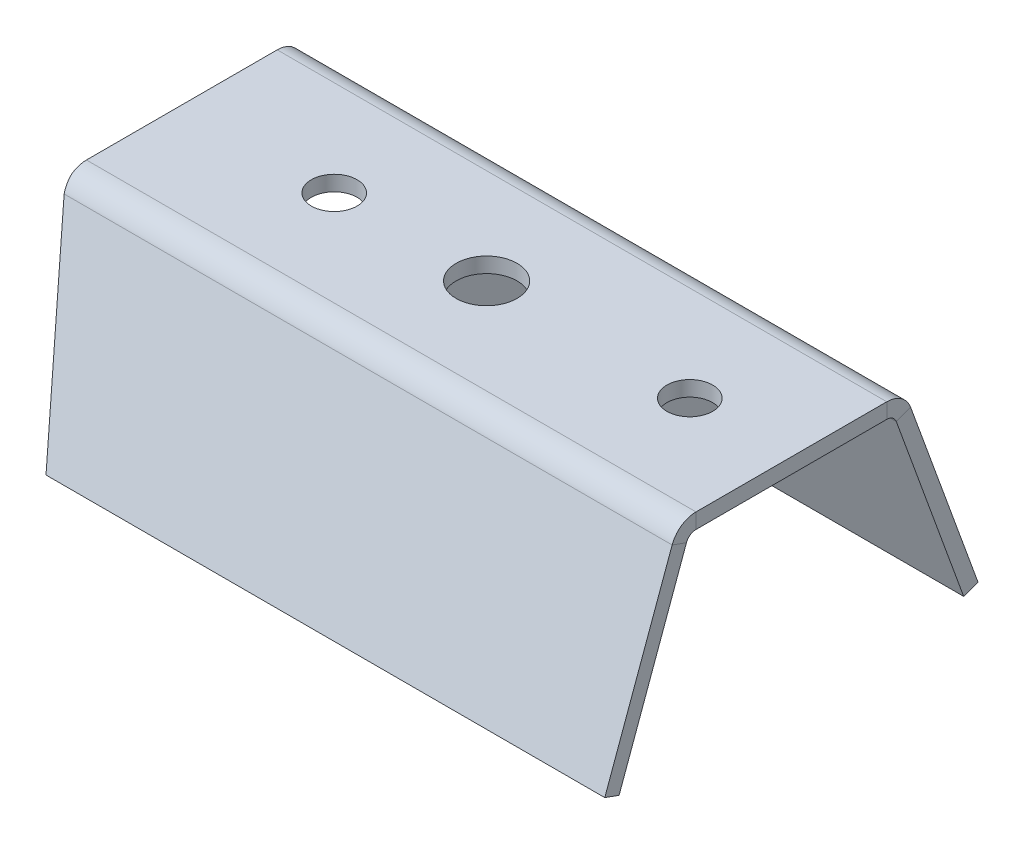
ISO-10303-21;
HEADER;
FILE_DESCRIPTION(('STEP AP214'),'2;1');
FILE_NAME('part.step','',(''),(''),'','','');
FILE_SCHEMA(('AUTOMOTIVE_DESIGN { 1 0 10303 214 1 1 1 1 }'));
ENDSEC;
DATA;
#1=APPLICATION_CONTEXT('core data for automotive mechanical design processes');
#2=APPLICATION_PROTOCOL_DEFINITION('international standard','automotive_design',2000,#1);
#3=PRODUCT_CONTEXT('',#1,'mechanical');
#4=PRODUCT('Part','Part','',(#3));
#5=PRODUCT_RELATED_PRODUCT_CATEGORY('part','',(#4));
#6=PRODUCT_DEFINITION_FORMATION('','',#4);
#7=PRODUCT_DEFINITION_CONTEXT('part definition',#1,'design');
#8=PRODUCT_DEFINITION('design','',#6,#7);
#9=PRODUCT_DEFINITION_SHAPE('','',#8);
#10=(LENGTH_UNIT() NAMED_UNIT(*) SI_UNIT(.MILLI.,.METRE.));
#11=(NAMED_UNIT(*) PLANE_ANGLE_UNIT() SI_UNIT($,.RADIAN.));
#12=(NAMED_UNIT(*) SI_UNIT($,.STERADIAN.) SOLID_ANGLE_UNIT());
#13=UNCERTAINTY_MEASURE_WITH_UNIT(LENGTH_MEASURE(1.E-05),#10,'distance_accuracy_value','');
#14=(GEOMETRIC_REPRESENTATION_CONTEXT(3) GLOBAL_UNCERTAINTY_ASSIGNED_CONTEXT((#13)) GLOBAL_UNIT_ASSIGNED_CONTEXT((#10,
#11,#12)) REPRESENTATION_CONTEXT('',''));
#15=CARTESIAN_POINT('',(0.,0.,0.));
#16=DIRECTION('',(0.,0.,1.));
#17=DIRECTION('',(1.,0.,0.));
#18=AXIS2_PLACEMENT_3D('',#15,#16,#17);
#19=CARTESIAN_POINT('',(60.,1.5,30.));
#20=DIRECTION('',(-1.,0.,0.));
#21=DIRECTION('',(0.,0.,1.));
#22=AXIS2_PLACEMENT_3D('',#19,#20,#21);
#23=PLANE('',#22);
#24=DIRECTION('',(0.,0.,-1.));
#25=VECTOR('',#24,1.);
#26=CARTESIAN_POINT('',(60.,1.5,30.));
#27=LINE('',#26,#25);
#28=CARTESIAN_POINT('',(60.,1.5,9.38912559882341));
#29=VERTEX_POINT('',#28);
#30=CARTESIAN_POINT('',(60.,1.5,-9.38912559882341));
#31=VERTEX_POINT('',#30);
#32=EDGE_CURVE('E476',#29,#31,#27,.T.);
#33=ORIENTED_EDGE('',*,*,#32,.F.);
#34=DIRECTION('',(0.,-1.,0.));
#35=VECTOR('',#34,1.);
#36=CARTESIAN_POINT('',(60.,1.5,9.38912559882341));
#37=LINE('',#36,#35);
#38=CARTESIAN_POINT('',(60.,0.,9.38912559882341));
#39=VERTEX_POINT('',#38);
#40=EDGE_CURVE('E12',#29,#39,#37,.T.);
#41=ORIENTED_EDGE('',*,*,#40,.T.);
#42=DIRECTION('',(0.,0.,-1.));
#43=VECTOR('',#42,1.);
#44=CARTESIAN_POINT('',(60.,0.,30.));
#45=LINE('',#44,#43);
#46=CARTESIAN_POINT('',(60.,0.,-9.38912559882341));
#47=VERTEX_POINT('',#46);
#48=EDGE_CURVE('E487',#39,#47,#45,.T.);
#49=ORIENTED_EDGE('',*,*,#48,.T.);
#50=DIRECTION('',(0.,-1.,0.));
#51=VECTOR('',#50,1.);
#52=CARTESIAN_POINT('',(60.,1.5,-9.38912559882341));
#53=LINE('',#52,#51);
#54=EDGE_CURVE('E478',#31,#47,#53,.T.);
#55=ORIENTED_EDGE('',*,*,#54,.F.);
#56=EDGE_LOOP('',(#33,#41,#49,#55));
#57=FACE_BOUND('',#56,.T.);
#58=ADVANCED_FACE('F55',(#57),#23,.F.);
#59=CARTESIAN_POINT('',(0.,1.5,-10.));
#60=DIRECTION('',(1.,0.,0.));
#61=DIRECTION('',(0.,0.,-1.));
#62=AXIS2_PLACEMENT_3D('',#59,#60,#61);
#63=PLANE('',#62);
#64=DIRECTION('',(0.,0.,1.));
#65=VECTOR('',#64,1.);
#66=CARTESIAN_POINT('',(0.,0.,-10.));
#67=LINE('',#66,#65);
#68=CARTESIAN_POINT('',(0.,0.,-9.38912559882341));
#69=VERTEX_POINT('',#68);
#70=CARTESIAN_POINT('',(0.,0.,9.38912559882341));
#71=VERTEX_POINT('',#70);
#72=EDGE_CURVE('E79',#69,#71,#67,.T.);
#73=ORIENTED_EDGE('',*,*,#72,.T.);
#74=DIRECTION('',(0.,1.,0.));
#75=VECTOR('',#74,1.);
#76=CARTESIAN_POINT('',(0.,1.5,9.38912559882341));
#77=LINE('',#76,#75);
#78=CARTESIAN_POINT('',(0.,1.5,9.38912559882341));
#79=VERTEX_POINT('',#78);
#80=EDGE_CURVE('E564',#71,#79,#77,.T.);
#81=ORIENTED_EDGE('',*,*,#80,.T.);
#82=DIRECTION('',(0.,0.,1.));
#83=VECTOR('',#82,1.);
#84=CARTESIAN_POINT('',(0.,1.5,-10.));
#85=LINE('',#84,#83);
#86=CARTESIAN_POINT('',(0.,1.5,-9.38912559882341));
#87=VERTEX_POINT('',#86);
#88=EDGE_CURVE('E483',#87,#79,#85,.T.);
#89=ORIENTED_EDGE('',*,*,#88,.F.);
#90=DIRECTION('',(0.,1.,0.));
#91=VECTOR('',#90,1.);
#92=CARTESIAN_POINT('',(0.,1.5,-9.38912559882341));
#93=LINE('',#92,#91);
#94=EDGE_CURVE('E565',#69,#87,#93,.T.);
#95=ORIENTED_EDGE('',*,*,#94,.F.);
#96=EDGE_LOOP('',(#73,#81,#89,#95));
#97=FACE_BOUND('',#96,.T.);
#98=ADVANCED_FACE('F457',(#97),#63,.F.);
#99=CARTESIAN_POINT('',(0.,0.,-30.));
#100=DIRECTION('',(0.,1.,0.));
#101=DIRECTION('',(0.,0.,1.));
#102=AXIS2_PLACEMENT_3D('',#99,#100,#101);
#103=PLANE('',#102);
#104=CARTESIAN_POINT('',(15.,0.,0.));
#105=DIRECTION('',(0.,1.,0.));
#106=DIRECTION('',(0.,0.,1.));
#107=AXIS2_PLACEMENT_3D('',#104,#105,#106);
#108=CIRCLE('',#107,2.25);
#109=CARTESIAN_POINT('',(15.,0.,2.25));
#110=VERTEX_POINT('',#109);
#111=EDGE_CURVE('E606',#110,#110,#108,.T.);
#112=ORIENTED_EDGE('',*,*,#111,.T.);
#113=EDGE_LOOP('',(#112));
#114=FACE_BOUND('',#113,.T.);
#115=CARTESIAN_POINT('',(50.,0.,0.));
#116=DIRECTION('',(0.,1.,0.));
#117=DIRECTION('',(0.,0.,1.));
#118=AXIS2_PLACEMENT_3D('',#115,#116,#117);
#119=CIRCLE('',#118,2.24999999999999);
#120=CARTESIAN_POINT('',(50.,0.,2.24999999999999));
#121=VERTEX_POINT('',#120);
#122=EDGE_CURVE('E571',#121,#121,#119,.T.);
#123=ORIENTED_EDGE('',*,*,#122,.T.);
#124=EDGE_LOOP('',(#123));
#125=FACE_BOUND('',#124,.T.);
#126=CARTESIAN_POINT('',(30.,0.,0.));
#127=DIRECTION('',(0.,1.,0.));
#128=DIRECTION('',(0.,0.,1.));
#129=AXIS2_PLACEMENT_3D('',#126,#127,#128);
#130=CIRCLE('',#129,3.);
#131=CARTESIAN_POINT('',(30.,0.,3.));
#132=VERTEX_POINT('',#131);
#133=EDGE_CURVE('E578',#132,#132,#130,.T.);
#134=ORIENTED_EDGE('',*,*,#133,.T.);
#135=EDGE_LOOP('',(#134));
#136=FACE_BOUND('',#135,.T.);
#137=ORIENTED_EDGE('',*,*,#48,.F.);
#138=DIRECTION('',(-1.,0.,0.));
#139=VECTOR('',#138,1.);
#140=CARTESIAN_POINT('',(0.,0.,9.38912559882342));
#141=LINE('',#140,#139);
#142=EDGE_CURVE('E63',#39,#71,#141,.T.);
#143=ORIENTED_EDGE('',*,*,#142,.T.);
#144=ORIENTED_EDGE('',*,*,#72,.F.);
#145=DIRECTION('',(-1.,0.,0.));
#146=VECTOR('',#145,1.);
#147=CARTESIAN_POINT('',(0.,0.,-9.38912559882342));
#148=LINE('',#147,#146);
#149=EDGE_CURVE('E582',#47,#69,#148,.T.);
#150=ORIENTED_EDGE('',*,*,#149,.F.);
#151=EDGE_LOOP('',(#137,#143,#144,#150));
#152=FACE_BOUND('',#151,.T.);
#153=ADVANCED_FACE('F460',(#114,#125,#136,#152),#103,.F.);
#154=CARTESIAN_POINT('',(0.,1.5,-30.));
#155=DIRECTION('',(0.,1.,0.));
#156=DIRECTION('',(0.,0.,1.));
#157=AXIS2_PLACEMENT_3D('',#154,#155,#156);
#158=PLANE('',#157);
#159=DIRECTION('',(-1.,0.,0.));
#160=VECTOR('',#159,1.);
#161=CARTESIAN_POINT('',(0.,1.5,9.38912559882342));
#162=LINE('',#161,#160);
#163=EDGE_CURVE('E557',#29,#79,#162,.T.);
#164=ORIENTED_EDGE('',*,*,#163,.F.);
#165=ORIENTED_EDGE('',*,*,#32,.T.);
#166=DIRECTION('',(-1.,0.,0.));
#167=VECTOR('',#166,1.);
#168=CARTESIAN_POINT('',(0.,1.5,-9.38912559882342));
#169=LINE('',#168,#167);
#170=EDGE_CURVE('E482',#31,#87,#169,.T.);
#171=ORIENTED_EDGE('',*,*,#170,.T.);
#172=ORIENTED_EDGE('',*,*,#88,.T.);
#173=EDGE_LOOP('',(#164,#165,#171,#172));
#174=FACE_BOUND('',#173,.T.);
#175=CARTESIAN_POINT('',(30.,1.5,0.));
#176=DIRECTION('',(0.,1.,0.));
#177=DIRECTION('',(0.,0.,1.));
#178=AXIS2_PLACEMENT_3D('',#175,#176,#177);
#179=CIRCLE('',#178,3.);
#180=CARTESIAN_POINT('',(30.,1.5,3.));
#181=VERTEX_POINT('',#180);
#182=EDGE_CURVE('E575',#181,#181,#179,.T.);
#183=ORIENTED_EDGE('',*,*,#182,.F.);
#184=EDGE_LOOP('',(#183));
#185=FACE_BOUND('',#184,.T.);
#186=CARTESIAN_POINT('',(50.,1.5,0.));
#187=DIRECTION('',(0.,1.,0.));
#188=DIRECTION('',(0.,0.,1.));
#189=AXIS2_PLACEMENT_3D('',#186,#187,#188);
#190=CIRCLE('',#189,2.24999999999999);
#191=CARTESIAN_POINT('',(50.,1.5,2.24999999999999));
#192=VERTEX_POINT('',#191);
#193=EDGE_CURVE('E569',#192,#192,#190,.T.);
#194=ORIENTED_EDGE('',*,*,#193,.F.);
#195=EDGE_LOOP('',(#194));
#196=FACE_BOUND('',#195,.T.);
#197=CARTESIAN_POINT('',(15.,1.5,0.));
#198=DIRECTION('',(0.,1.,0.));
#199=DIRECTION('',(0.,0.,1.));
#200=AXIS2_PLACEMENT_3D('',#197,#198,#199);
#201=CIRCLE('',#200,2.25);
#202=CARTESIAN_POINT('',(15.,1.5,2.25));
#203=VERTEX_POINT('',#202);
#204=EDGE_CURVE('E433',#203,#203,#201,.T.);
#205=ORIENTED_EDGE('',*,*,#204,.F.);
#206=EDGE_LOOP('',(#205));
#207=FACE_BOUND('',#206,.T.);
#208=ADVANCED_FACE('F455',(#174,#185,#196,#207),#158,.T.);
#209=CARTESIAN_POINT('',(50.,1.5,0.));
#210=DIRECTION('',(0.,-1.,0.));
#211=DIRECTION('',(0.,0.,-1.));
#212=AXIS2_PLACEMENT_3D('',#209,#210,#211);
#213=CYLINDRICAL_SURFACE('',#212,2.24999999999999);
#214=ORIENTED_EDGE('',*,*,#193,.T.);
#215=EDGE_LOOP('',(#214));
#216=FACE_BOUND('',#215,.T.);
#217=ORIENTED_EDGE('',*,*,#122,.F.);
#218=EDGE_LOOP('',(#217));
#219=FACE_BOUND('',#218,.T.);
#220=ADVANCED_FACE('F451',(#216,#219),#213,.F.);
#221=CARTESIAN_POINT('',(30.,1.5,0.));
#222=DIRECTION('',(0.,-1.,0.));
#223=DIRECTION('',(0.,0.,-1.));
#224=AXIS2_PLACEMENT_3D('',#221,#222,#223);
#225=CYLINDRICAL_SURFACE('',#224,3.);
#226=ORIENTED_EDGE('',*,*,#182,.T.);
#227=EDGE_LOOP('',(#226));
#228=FACE_BOUND('',#227,.T.);
#229=ORIENTED_EDGE('',*,*,#133,.F.);
#230=EDGE_LOOP('',(#229));
#231=FACE_BOUND('',#230,.T.);
#232=ADVANCED_FACE('F447',(#228,#231),#225,.F.);
#233=CARTESIAN_POINT('',(15.,1.5,0.));
#234=DIRECTION('',(0.,-1.,0.));
#235=DIRECTION('',(0.,0.,-1.));
#236=AXIS2_PLACEMENT_3D('',#233,#234,#235);
#237=CYLINDRICAL_SURFACE('',#236,2.25);
#238=ORIENTED_EDGE('',*,*,#204,.T.);
#239=EDGE_LOOP('',(#238));
#240=FACE_BOUND('',#239,.T.);
#241=ORIENTED_EDGE('',*,*,#111,.F.);
#242=EDGE_LOOP('',(#241));
#243=FACE_BOUND('',#242,.T.);
#244=ADVANCED_FACE('F444',(#240,#243),#237,.F.);
#245=CARTESIAN_POINT('',(60.,-1.,-9.38912559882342));
#246=DIRECTION('',(1.,0.,0.));
#247=DIRECTION('',(0.,0.,-1.));
#248=AXIS2_PLACEMENT_3D('',#245,#246,#247);
#249=PLANE('',#248);
#250=ORIENTED_EDGE('',*,*,#54,.T.);
#251=CARTESIAN_POINT('',(60.,-1.,-9.38912559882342));
#252=DIRECTION('',(-1.,0.,0.));
#253=DIRECTION('',(0.,0.,1.));
#254=AXIS2_PLACEMENT_3D('',#251,#252,#253);
#255=CIRCLE('',#254,1.);
#256=CARTESIAN_POINT('',(60.,-0.657979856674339,-10.3288182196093));
#257=VERTEX_POINT('',#256);
#258=EDGE_CURVE('E310',#47,#257,#255,.T.);
#259=ORIENTED_EDGE('',*,*,#258,.T.);
#260=DIRECTION('',(0.,-0.342020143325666,0.93969262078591));
#261=VECTOR('',#260,1.);
#262=CARTESIAN_POINT('',(60.,-0.14494964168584,-11.7383571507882));
#263=LINE('',#262,#261);
#264=CARTESIAN_POINT('',(60.,-0.14494964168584,-11.7383571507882));
#265=VERTEX_POINT('',#264);
#266=EDGE_CURVE('E315',#265,#257,#263,.T.);
#267=ORIENTED_EDGE('',*,*,#266,.F.);
#268=CARTESIAN_POINT('',(60.,-1.,-9.38912559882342));
#269=DIRECTION('',(-1.,0.,0.));
#270=DIRECTION('',(0.,0.,1.));
#271=AXIS2_PLACEMENT_3D('',#268,#269,#270);
#272=CIRCLE('',#271,2.5);
#273=EDGE_CURVE('E331',#31,#265,#272,.T.);
#274=ORIENTED_EDGE('',*,*,#273,.F.);
#275=EDGE_LOOP('',(#250,#259,#267,#274));
#276=FACE_BOUND('',#275,.T.);
#277=ADVANCED_FACE('F443',(#276),#249,.T.);
#278=CARTESIAN_POINT('',(0.152718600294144,-0.144949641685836,-11.7383571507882));
#279=CARTESIAN_POINT('',(0.101675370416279,0.334692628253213,-11.5637816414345));
#280=CARTESIAN_POINT('',(0.0510432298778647,0.755112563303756,-11.2411820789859));
#281=CARTESIAN_POINT('',(0.,1.04788011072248,-10.823066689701));
#282=CARTESIAN_POINT('',(0.152718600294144,-0.657979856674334,-10.3288182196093));
#283=CARTESIAN_POINT('',(0.101679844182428,-0.46613976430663,-10.2589941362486));
#284=CARTESIAN_POINT('',(0.0510387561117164,-0.29794471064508,-10.1299335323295));
#285=CARTESIAN_POINT('',(0.,-0.180847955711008,-9.96270203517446));
#286=B_SPLINE_SURFACE_WITH_KNOTS('',1,3,((#278,#279,#280,#281),(#282,#283,#284,#285)),
.UNSPECIFIED.,.F.,.F.,.F.,(2,2),(4,4),(0.,1.),(0.,1.),.UNSPECIFIED.);
#287=CARTESIAN_POINT('',(0.152718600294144,-0.144949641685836,-11.7383571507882));
#288=CARTESIAN_POINT('',(0.152718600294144,-0.657979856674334,-10.3288182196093));
#289=B_SPLINE_CURVE_WITH_KNOTS('',1,(#287,#288),.UNSPECIFIED.,.F.,.F.,(2,2),(0.,1.),.UNSPECIFIED.);
#290=CARTESIAN_POINT('',(0.152718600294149,-0.657979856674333,-10.3288182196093));
#291=VERTEX_POINT('',#290);
#292=CARTESIAN_POINT('',(0.152718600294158,-0.144949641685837,-11.7383571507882));
#293=VERTEX_POINT('',#292);
#294=EDGE_CURVE('E311',#291,#293,#289,.F.);
#295=CARTESIAN_POINT('',(0.152718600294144,-0.657979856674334,-10.3288182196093));
#296=CARTESIAN_POINT('',(0.101679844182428,-0.46613976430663,-10.2589941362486));
#297=CARTESIAN_POINT('',(0.0510387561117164,-0.29794471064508,-10.1299335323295));
#298=CARTESIAN_POINT('',(0.,-0.180847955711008,-9.96270203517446));
#299=B_SPLINE_CURVE_WITH_KNOTS('',3,(#295,#296,#297,#298),.UNSPECIFIED.,.F.,.F.,(4,4),(0.,1.),.UNSPECIFIED.);
#300=CARTESIAN_POINT('',(0.,-0.180847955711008,-9.96270203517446));
#301=VERTEX_POINT('',#300);
#302=EDGE_CURVE('E380',#291,#301,#299,.T.);
#303=CARTESIAN_POINT('',(0.,-0.180847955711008,-9.96270203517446));
#304=CARTESIAN_POINT('',(0.,1.04788011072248,-10.823066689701));
#305=B_SPLINE_CURVE_WITH_KNOTS('',1,(#303,#304),.UNSPECIFIED.,.F.,.F.,(2,2),(0.,1.),.UNSPECIFIED.);
#306=CARTESIAN_POINT('',(0.,1.04788011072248,-10.823066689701));
#307=VERTEX_POINT('',#306);
#308=EDGE_CURVE('E417',#301,#307,#305,.T.);
#309=CARTESIAN_POINT('',(0.,1.04788011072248,-10.823066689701));
#310=CARTESIAN_POINT('',(0.0510432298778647,0.755112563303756,-11.2411820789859));
#311=CARTESIAN_POINT('',(0.101675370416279,0.334692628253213,-11.5637816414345));
#312=CARTESIAN_POINT('',(0.152718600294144,-0.144949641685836,-11.7383571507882));
#313=B_SPLINE_CURVE_WITH_KNOTS('',3,(#309,#310,#311,#312),.UNSPECIFIED.,.F.,.F.,(4,4),(0.,1.),.UNSPECIFIED.);
#314=EDGE_CURVE('E334',#293,#307,#313,.F.);
#315=ORIENTED_EDGE('',*,*,#294,.F.);
#316=ORIENTED_EDGE('',*,*,#302,.T.);
#317=ORIENTED_EDGE('',*,*,#308,.T.);
#318=ORIENTED_EDGE('',*,*,#314,.F.);
#319=EDGE_LOOP('',(#315,#316,#317,#318));
#320=FACE_BOUND('',#319,.T.);
#321=ADVANCED_FACE('F354',(#320),#286,.T.);
#322=CARTESIAN_POINT('',(0.,-1.,-9.38912559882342));
#323=DIRECTION('',(-1.,0.,0.));
#324=DIRECTION('',(0.,0.,1.));
#325=AXIS2_PLACEMENT_3D('',#322,#323,#324);
#326=PLANE('',#325);
#327=CARTESIAN_POINT('',(0.,-1.,-9.38912559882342));
#328=DIRECTION('',(-1.,0.,0.));
#329=DIRECTION('',(0.,0.,1.));
#330=AXIS2_PLACEMENT_3D('',#327,#328,#329);
#331=CIRCLE('',#330,1.);
#332=EDGE_CURVE('E335',#301,#69,#331,.F.);
#333=ORIENTED_EDGE('',*,*,#332,.T.);
#334=ORIENTED_EDGE('',*,*,#94,.T.);
#335=CARTESIAN_POINT('',(0.,-1.,-9.38912559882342));
#336=DIRECTION('',(1.,0.,0.));
#337=DIRECTION('',(0.,0.,-1.));
#338=AXIS2_PLACEMENT_3D('',#335,#336,#337);
#339=CIRCLE('',#338,2.5);
#340=EDGE_CURVE('E604',#307,#87,#339,.T.);
#341=ORIENTED_EDGE('',*,*,#340,.F.);
#342=ORIENTED_EDGE('',*,*,#308,.F.);
#343=EDGE_LOOP('',(#333,#334,#341,#342));
#344=FACE_BOUND('',#343,.T.);
#345=ADVANCED_FACE('F352',(#344),#326,.T.);
#346=CARTESIAN_POINT('',(90.0311808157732,-1.,-9.38912559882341));
#347=DIRECTION('',(-1.,0.,0.));
#348=DIRECTION('',(0.,0.,1.));
#349=AXIS2_PLACEMENT_3D('',#346,#347,#348);
#350=CYLINDRICAL_SURFACE('',#349,2.5);
#351=ORIENTED_EDGE('',*,*,#314,.T.);
#352=ORIENTED_EDGE('',*,*,#340,.T.);
#353=ORIENTED_EDGE('',*,*,#170,.F.);
#354=ORIENTED_EDGE('',*,*,#273,.T.);
#355=DIRECTION('',(-1.,0.,0.));
#356=VECTOR('',#355,1.);
#357=CARTESIAN_POINT('',(0.,-0.144949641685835,-11.7383571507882));
#358=LINE('',#357,#356);
#359=EDGE_CURVE('E330',#265,#293,#358,.T.);
#360=ORIENTED_EDGE('',*,*,#359,.T.);
#361=EDGE_LOOP('',(#351,#352,#353,#354,#360));
#362=FACE_BOUND('',#361,.T.);
#363=ADVANCED_FACE('F341',(#362),#350,.T.);
#364=CARTESIAN_POINT('',(90.0311808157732,-1.,-9.38912559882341));
#365=DIRECTION('',(-1.,0.,0.));
#366=DIRECTION('',(0.,0.,1.));
#367=AXIS2_PLACEMENT_3D('',#364,#365,#366);
#368=CYLINDRICAL_SURFACE('',#367,1.);
#369=ORIENTED_EDGE('',*,*,#302,.F.);
#370=DIRECTION('',(-1.,0.,0.));
#371=VECTOR('',#370,1.);
#372=CARTESIAN_POINT('',(0.,-0.657979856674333,-10.3288182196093));
#373=LINE('',#372,#371);
#374=EDGE_CURVE('E314',#257,#291,#373,.T.);
#375=ORIENTED_EDGE('',*,*,#374,.F.);
#376=ORIENTED_EDGE('',*,*,#258,.F.);
#377=ORIENTED_EDGE('',*,*,#149,.T.);
#378=ORIENTED_EDGE('',*,*,#332,.F.);
#379=EDGE_LOOP('',(#369,#375,#376,#377,#378));
#380=FACE_BOUND('',#379,.T.);
#381=ADVANCED_FACE('F351',(#380),#368,.F.);
#382=CARTESIAN_POINT('',(60.,-18.3647678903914,-18.3698286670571));
#383=DIRECTION('',(0.,0.93969262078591,0.342020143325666));
#384=DIRECTION('',(1.,0.,0.));
#385=AXIS2_PLACEMENT_3D('',#382,#383,#384);
#386=PLANE('',#385);
#387=DIRECTION('',(-1.,0.,0.));
#388=VECTOR('',#387,1.);
#389=CARTESIAN_POINT('',(60.,-18.8777981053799,-16.9602897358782));
#390=LINE('',#389,#388);
#391=CARTESIAN_POINT('',(60.,-18.8777981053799,-16.9602897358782));
#392=VERTEX_POINT('',#391);
#393=CARTESIAN_POINT('',(5.,-18.8777981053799,-16.9602897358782));
#394=VERTEX_POINT('',#393);
#395=EDGE_CURVE('E327',#392,#394,#390,.T.);
#396=ORIENTED_EDGE('',*,*,#395,.T.);
#397=DIRECTION('',(0.,-0.342020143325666,0.93969262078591));
#398=VECTOR('',#397,1.);
#399=CARTESIAN_POINT('',(5.,-18.3647678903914,-18.3698286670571));
#400=LINE('',#399,#398);
#401=CARTESIAN_POINT('',(5.,-18.3647678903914,-18.3698286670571));
#402=VERTEX_POINT('',#401);
#403=EDGE_CURVE('E302',#402,#394,#400,.T.);
#404=ORIENTED_EDGE('',*,*,#403,.F.);
#405=DIRECTION('',(-1.,0.,0.));
#406=VECTOR('',#405,1.);
#407=CARTESIAN_POINT('',(60.,-18.3647678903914,-18.3698286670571));
#408=LINE('',#407,#406);
#409=CARTESIAN_POINT('',(60.,-18.3647678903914,-18.3698286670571));
#410=VERTEX_POINT('',#409);
#411=EDGE_CURVE('E319',#410,#402,#408,.T.);
#412=ORIENTED_EDGE('',*,*,#411,.F.);
#413=DIRECTION('',(0.,-0.342020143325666,0.93969262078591));
#414=VECTOR('',#413,1.);
#415=CARTESIAN_POINT('',(60.,-18.3647678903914,-18.3698286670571));
#416=LINE('',#415,#414);
#417=EDGE_CURVE('E324',#410,#392,#416,.T.);
#418=ORIENTED_EDGE('',*,*,#417,.T.);
#419=EDGE_LOOP('',(#396,#404,#412,#418));
#420=FACE_BOUND('',#419,.T.);
#421=ADVANCED_FACE('F263',(#420),#386,.F.);
#422=CARTESIAN_POINT('',(0.,-18.3647678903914,-18.3698286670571));
#423=DIRECTION('',(0.,0.342020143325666,-0.93969262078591));
#424=DIRECTION('',(0.,0.93969262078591,0.342020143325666));
#425=AXIS2_PLACEMENT_3D('',#422,#423,#424);
#426=PLANE('',#425);
#427=ORIENTED_EDGE('',*,*,#359,.F.);
#428=DIRECTION('',(0.,-0.93969262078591,-0.342020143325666));
#429=VECTOR('',#428,1.);
#430=CARTESIAN_POINT('',(60.,38.0167893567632,2.15137993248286));
#431=LINE('',#430,#429);
#432=EDGE_CURVE('E322',#265,#410,#431,.T.);
#433=ORIENTED_EDGE('',*,*,#432,.T.);
#434=ORIENTED_EDGE('',*,*,#411,.T.);
#435=DIRECTION('',(-0.242535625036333,0.911635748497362,0.331808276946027));
#436=VECTOR('',#435,1.);
#437=CARTESIAN_POINT('',(5.,-18.3647678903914,-18.3698286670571));
#438=LINE('',#437,#436);
#439=EDGE_CURVE('E318',#402,#293,#438,.T.);
#440=ORIENTED_EDGE('',*,*,#439,.T.);
#441=EDGE_LOOP('',(#427,#433,#434,#440));
#442=FACE_BOUND('',#441,.T.);
#443=ADVANCED_FACE('F626',(#442),#426,.T.);
#444=CARTESIAN_POINT('',(60.,38.0167893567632,2.15137993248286));
#445=DIRECTION('',(-1.,0.,0.));
#446=DIRECTION('',(0.,0.93969262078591,0.342020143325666));
#447=AXIS2_PLACEMENT_3D('',#444,#445,#446);
#448=PLANE('',#447);
#449=ORIENTED_EDGE('',*,*,#432,.F.);
#450=ORIENTED_EDGE('',*,*,#266,.T.);
#451=DIRECTION('',(0.,-0.93969262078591,-0.342020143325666));
#452=VECTOR('',#451,1.);
#453=CARTESIAN_POINT('',(60.,37.5037591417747,3.56091886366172));
#454=LINE('',#453,#452);
#455=EDGE_CURVE('E312',#257,#392,#454,.T.);
#456=ORIENTED_EDGE('',*,*,#455,.T.);
#457=ORIENTED_EDGE('',*,*,#417,.F.);
#458=EDGE_LOOP('',(#449,#450,#456,#457));
#459=FACE_BOUND('',#458,.T.);
#460=ADVANCED_FACE('F536',(#459),#448,.F.);
#461=CARTESIAN_POINT('',(0.,-18.8777981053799,-16.9602897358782));
#462=DIRECTION('',(0.,0.342020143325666,-0.93969262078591));
#463=DIRECTION('',(0.,0.93969262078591,0.342020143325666));
#464=AXIS2_PLACEMENT_3D('',#461,#462,#463);
#465=PLANE('',#464);
#466=ORIENTED_EDGE('',*,*,#455,.F.);
#467=ORIENTED_EDGE('',*,*,#374,.T.);
#468=DIRECTION('',(-0.242535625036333,0.911635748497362,0.331808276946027));
#469=VECTOR('',#468,1.);
#470=CARTESIAN_POINT('',(5.,-18.8777981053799,-16.9602897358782));
#471=LINE('',#470,#469);
#472=EDGE_CURVE('E538',#394,#291,#471,.T.);
#473=ORIENTED_EDGE('',*,*,#472,.F.);
#474=ORIENTED_EDGE('',*,*,#395,.F.);
#475=EDGE_LOOP('',(#466,#467,#473,#474));
#476=FACE_BOUND('',#475,.T.);
#477=ADVANCED_FACE('F531',(#476),#465,.F.);
#478=CARTESIAN_POINT('',(5.,-18.3647678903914,-18.3698286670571));
#479=DIRECTION('',(0.970142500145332,0.22790893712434,0.0829520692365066));
#480=DIRECTION('',(0.242535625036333,-0.911635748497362,-0.331808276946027));
#481=AXIS2_PLACEMENT_3D('',#478,#479,#480);
#482=PLANE('',#481);
#483=ORIENTED_EDGE('',*,*,#472,.T.);
#484=ORIENTED_EDGE('',*,*,#294,.T.);
#485=ORIENTED_EDGE('',*,*,#439,.F.);
#486=ORIENTED_EDGE('',*,*,#403,.T.);
#487=EDGE_LOOP('',(#483,#484,#485,#486));
#488=FACE_BOUND('',#487,.T.);
#489=ADVANCED_FACE('F355',(#488),#482,.F.);
#490=CARTESIAN_POINT('',(60.,-1.,9.38912559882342));
#491=DIRECTION('',(1.,0.,0.));
#492=DIRECTION('',(0.,0.,-1.));
#493=AXIS2_PLACEMENT_3D('',#490,#491,#492);
#494=PLANE('',#493);
#495=DIRECTION('',(0.,-0.342020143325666,-0.93969262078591));
#496=VECTOR('',#495,1.);
#497=CARTESIAN_POINT('',(60.,-0.144949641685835,11.7383571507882));
#498=LINE('',#497,#496);
#499=CARTESIAN_POINT('',(60.,-0.144949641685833,11.7383571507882));
#500=VERTEX_POINT('',#499);
#501=CARTESIAN_POINT('',(60.,-0.657979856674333,10.3288182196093));
#502=VERTEX_POINT('',#501);
#503=EDGE_CURVE('E189',#500,#502,#498,.T.);
#504=ORIENTED_EDGE('',*,*,#503,.T.);
#505=CARTESIAN_POINT('',(60.,-1.,9.38912559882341));
#506=DIRECTION('',(1.,0.,0.));
#507=DIRECTION('',(0.,0.,-1.));
#508=AXIS2_PLACEMENT_3D('',#505,#506,#507);
#509=CIRCLE('',#508,1.);
#510=EDGE_CURVE('E71',#502,#39,#509,.F.);
#511=ORIENTED_EDGE('',*,*,#510,.T.);
#512=ORIENTED_EDGE('',*,*,#40,.F.);
#513=CARTESIAN_POINT('',(60.,-1.,9.38912559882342));
#514=DIRECTION('',(-1.,0.,0.));
#515=DIRECTION('',(0.,0.,1.));
#516=AXIS2_PLACEMENT_3D('',#513,#514,#515);
#517=CIRCLE('',#516,2.5);
#518=EDGE_CURVE('E191',#500,#29,#517,.T.);
#519=ORIENTED_EDGE('',*,*,#518,.F.);
#520=EDGE_LOOP('',(#504,#511,#512,#519));
#521=FACE_BOUND('',#520,.T.);
#522=ADVANCED_FACE('F262',(#521),#494,.T.);
#523=CARTESIAN_POINT('',(0.,-1.,9.38912559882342));
#524=DIRECTION('',(-1.,0.,0.));
#525=DIRECTION('',(0.,0.,1.));
#526=AXIS2_PLACEMENT_3D('',#523,#524,#525);
#527=PLANE('',#526);
#528=ORIENTED_EDGE('',*,*,#80,.F.);
#529=CARTESIAN_POINT('',(0.,-1.,9.38912559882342));
#530=DIRECTION('',(1.,0.,0.));
#531=DIRECTION('',(0.,0.,-1.));
#532=AXIS2_PLACEMENT_3D('',#529,#530,#531);
#533=CIRCLE('',#532,1.);
#534=CARTESIAN_POINT('',(0.,-0.180847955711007,9.96270203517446));
#535=VERTEX_POINT('',#534);
#536=EDGE_CURVE('E197',#71,#535,#533,.T.);
#537=ORIENTED_EDGE('',*,*,#536,.T.);
#538=CARTESIAN_POINT('',(0.,1.04788011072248,10.823066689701));
#539=CARTESIAN_POINT('',(0.,-0.180847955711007,9.96270203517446));
#540=B_SPLINE_CURVE_WITH_KNOTS('',1,(#538,#539),.UNSPECIFIED.,.F.,.F.,(2,2),(0.,1.),.UNSPECIFIED.);
#541=CARTESIAN_POINT('',(0.,1.04788011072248,10.823066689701));
#542=VERTEX_POINT('',#541);
#543=EDGE_CURVE('E289',#535,#542,#540,.F.);
#544=ORIENTED_EDGE('',*,*,#543,.T.);
#545=CARTESIAN_POINT('',(0.,-1.,9.38912559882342));
#546=DIRECTION('',(1.,0.,0.));
#547=DIRECTION('',(0.,0.,-1.));
#548=AXIS2_PLACEMENT_3D('',#545,#546,#547);
#549=CIRCLE('',#548,2.5);
#550=EDGE_CURVE('E194',#79,#542,#549,.T.);
#551=ORIENTED_EDGE('',*,*,#550,.F.);
#552=EDGE_LOOP('',(#528,#537,#544,#551));
#553=FACE_BOUND('',#552,.T.);
#554=ADVANCED_FACE('F217',(#553),#527,.T.);
#555=CARTESIAN_POINT('',(0.,1.04788011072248,10.823066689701));
#556=CARTESIAN_POINT('',(0.0510432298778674,0.755112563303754,11.2411820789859));
#557=CARTESIAN_POINT('',(0.101675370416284,0.334692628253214,11.5637816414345));
#558=CARTESIAN_POINT('',(0.152718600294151,-0.144949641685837,11.7383571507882));
#559=CARTESIAN_POINT('',(0.,-0.180847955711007,9.96270203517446));
#560=CARTESIAN_POINT('',(0.0510387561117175,-0.297944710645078,10.1299335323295));
#561=CARTESIAN_POINT('',(0.101679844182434,-0.466139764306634,10.2589941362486));
#562=CARTESIAN_POINT('',(0.152718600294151,-0.657979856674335,10.3288182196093));
#563=B_SPLINE_SURFACE_WITH_KNOTS('',1,3,((#555,#556,#557,#558),(#559,#560,#561,#562)),
.UNSPECIFIED.,.F.,.F.,.F.,(2,2),(4,4),(0.,1.),(0.,1.),.UNSPECIFIED.);
#564=CARTESIAN_POINT('',(0.,-0.180847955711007,9.96270203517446));
#565=CARTESIAN_POINT('',(0.0510387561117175,-0.297944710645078,10.1299335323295));
#566=CARTESIAN_POINT('',(0.101679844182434,-0.466139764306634,10.2589941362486));
#567=CARTESIAN_POINT('',(0.152718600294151,-0.657979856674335,10.3288182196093));
#568=B_SPLINE_CURVE_WITH_KNOTS('',3,(#564,#565,#566,#567),.UNSPECIFIED.,.F.,.F.,(4,4),(0.,1.),.UNSPECIFIED.);
#569=CARTESIAN_POINT('',(0.152718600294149,-0.657979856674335,10.3288182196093));
#570=VERTEX_POINT('',#569);
#571=EDGE_CURVE('E195',#535,#570,#568,.T.);
#572=CARTESIAN_POINT('',(0.152718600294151,-0.657979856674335,10.3288182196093));
#573=CARTESIAN_POINT('',(0.152718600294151,-0.144949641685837,11.7383571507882));
#574=B_SPLINE_CURVE_WITH_KNOTS('',1,(#572,#573),.UNSPECIFIED.,.F.,.F.,(2,2),(0.,1.),.UNSPECIFIED.);
#575=CARTESIAN_POINT('',(0.152718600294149,-0.144949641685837,11.7383571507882));
#576=VERTEX_POINT('',#575);
#577=EDGE_CURVE('E167',#570,#576,#574,.T.);
#578=CARTESIAN_POINT('',(0.152718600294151,-0.144949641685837,11.7383571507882));
#579=CARTESIAN_POINT('',(0.101675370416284,0.334692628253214,11.5637816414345));
#580=CARTESIAN_POINT('',(0.0510432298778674,0.755112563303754,11.2411820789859));
#581=CARTESIAN_POINT('',(0.,1.04788011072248,10.823066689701));
#582=B_SPLINE_CURVE_WITH_KNOTS('',3,(#578,#579,#580,#581),.UNSPECIFIED.,.F.,.F.,(4,4),(0.,1.),.UNSPECIFIED.);
#583=EDGE_CURVE('E245',#542,#576,#582,.F.);
#584=ORIENTED_EDGE('',*,*,#571,.T.);
#585=ORIENTED_EDGE('',*,*,#577,.T.);
#586=ORIENTED_EDGE('',*,*,#583,.F.);
#587=ORIENTED_EDGE('',*,*,#543,.F.);
#588=EDGE_LOOP('',(#584,#585,#586,#587));
#589=FACE_BOUND('',#588,.T.);
#590=ADVANCED_FACE('F215',(#589),#563,.T.);
#591=CARTESIAN_POINT('',(-30.0311808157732,-1.,9.38912559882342));
#592=DIRECTION('',(1.,0.,0.));
#593=DIRECTION('',(0.,0.,-1.));
#594=AXIS2_PLACEMENT_3D('',#591,#592,#593);
#595=CYLINDRICAL_SURFACE('',#594,2.5);
#596=ORIENTED_EDGE('',*,*,#550,.T.);
#597=ORIENTED_EDGE('',*,*,#583,.T.);
#598=DIRECTION('',(-1.,0.,0.));
#599=VECTOR('',#598,1.);
#600=CARTESIAN_POINT('',(0.,-0.144949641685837,11.7383571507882));
#601=LINE('',#600,#599);
#602=EDGE_CURVE('E491',#500,#576,#601,.T.);
#603=ORIENTED_EDGE('',*,*,#602,.F.);
#604=ORIENTED_EDGE('',*,*,#518,.T.);
#605=ORIENTED_EDGE('',*,*,#163,.T.);
#606=EDGE_LOOP('',(#596,#597,#603,#604,#605));
#607=FACE_BOUND('',#606,.T.);
#608=ADVANCED_FACE('F204',(#607),#595,.T.);
#609=CARTESIAN_POINT('',(-30.0311808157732,-1.,9.38912559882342));
#610=DIRECTION('',(1.,0.,0.));
#611=DIRECTION('',(0.,0.,-1.));
#612=AXIS2_PLACEMENT_3D('',#609,#610,#611);
#613=CYLINDRICAL_SURFACE('',#612,1.);
#614=ORIENTED_EDGE('',*,*,#536,.F.);
#615=ORIENTED_EDGE('',*,*,#142,.F.);
#616=ORIENTED_EDGE('',*,*,#510,.F.);
#617=DIRECTION('',(-1.,0.,0.));
#618=VECTOR('',#617,1.);
#619=CARTESIAN_POINT('',(0.,-0.657979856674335,10.3288182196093));
#620=LINE('',#619,#618);
#621=EDGE_CURVE('E186',#502,#570,#620,.T.);
#622=ORIENTED_EDGE('',*,*,#621,.T.);
#623=ORIENTED_EDGE('',*,*,#571,.F.);
#624=EDGE_LOOP('',(#614,#615,#616,#622,#623));
#625=FACE_BOUND('',#624,.T.);
#626=ADVANCED_FACE('F214',(#625),#613,.F.);
#627=CARTESIAN_POINT('',(60.,-18.3647678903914,18.3698286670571));
#628=DIRECTION('',(0.,0.93969262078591,-0.342020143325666));
#629=DIRECTION('',(-1.,0.,0.));
#630=AXIS2_PLACEMENT_3D('',#627,#628,#629);
#631=PLANE('',#630);
#632=DIRECTION('',(1.,0.,0.));
#633=VECTOR('',#632,1.);
#634=CARTESIAN_POINT('',(60.,-18.8777981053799,16.9602897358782));
#635=LINE('',#634,#633);
#636=CARTESIAN_POINT('',(5.,-18.8777981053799,16.9602897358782));
#637=VERTEX_POINT('',#636);
#638=CARTESIAN_POINT('',(60.,-18.8777981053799,16.9602897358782));
#639=VERTEX_POINT('',#638);
#640=EDGE_CURVE('E178',#637,#639,#635,.T.);
#641=ORIENTED_EDGE('',*,*,#640,.T.);
#642=DIRECTION('',(0.,-0.342020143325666,-0.93969262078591));
#643=VECTOR('',#642,1.);
#644=CARTESIAN_POINT('',(60.,-18.3647678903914,18.3698286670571));
#645=LINE('',#644,#643);
#646=CARTESIAN_POINT('',(60.,-18.3647678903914,18.3698286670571));
#647=VERTEX_POINT('',#646);
#648=EDGE_CURVE('E173',#647,#639,#645,.T.);
#649=ORIENTED_EDGE('',*,*,#648,.F.);
#650=DIRECTION('',(1.,0.,0.));
#651=VECTOR('',#650,1.);
#652=CARTESIAN_POINT('',(60.,-18.3647678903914,18.3698286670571));
#653=LINE('',#652,#651);
#654=CARTESIAN_POINT('',(5.,-18.3647678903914,18.3698286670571));
#655=VERTEX_POINT('',#654);
#656=EDGE_CURVE('E174',#655,#647,#653,.T.);
#657=ORIENTED_EDGE('',*,*,#656,.F.);
#658=DIRECTION('',(0.,-0.342020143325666,-0.93969262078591));
#659=VECTOR('',#658,1.);
#660=CARTESIAN_POINT('',(5.,-18.3647678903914,18.3698286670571));
#661=LINE('',#660,#659);
#662=EDGE_CURVE('E164',#655,#637,#661,.T.);
#663=ORIENTED_EDGE('',*,*,#662,.T.);
#664=EDGE_LOOP('',(#641,#649,#657,#663));
#665=FACE_BOUND('',#664,.T.);
#666=ADVANCED_FACE('F176',(#665),#631,.F.);
#667=CARTESIAN_POINT('',(0.,38.0167893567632,-2.15137993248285));
#668=DIRECTION('',(0.,0.342020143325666,0.93969262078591));
#669=DIRECTION('',(0.,-0.93969262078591,0.342020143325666));
#670=AXIS2_PLACEMENT_3D('',#667,#668,#669);
#671=PLANE('',#670);
#672=DIRECTION('',(0.,0.93969262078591,-0.342020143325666));
#673=VECTOR('',#672,1.);
#674=CARTESIAN_POINT('',(60.,-18.3647678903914,18.3698286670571));
#675=LINE('',#674,#673);
#676=EDGE_CURVE('E180',#647,#500,#675,.T.);
#677=ORIENTED_EDGE('',*,*,#676,.T.);
#678=ORIENTED_EDGE('',*,*,#602,.T.);
#679=DIRECTION('',(0.242535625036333,-0.911635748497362,0.331808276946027));
#680=VECTOR('',#679,1.);
#681=CARTESIAN_POINT('',(5.,-18.3647678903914,18.3698286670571));
#682=LINE('',#681,#680);
#683=EDGE_CURVE('E493',#576,#655,#682,.T.);
#684=ORIENTED_EDGE('',*,*,#683,.T.);
#685=ORIENTED_EDGE('',*,*,#656,.T.);
#686=EDGE_LOOP('',(#677,#678,#684,#685));
#687=FACE_BOUND('',#686,.T.);
#688=ADVANCED_FACE('F512',(#687),#671,.T.);
#689=CARTESIAN_POINT('',(5.,-18.3647678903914,18.3698286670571));
#690=DIRECTION('',(0.970142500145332,0.22790893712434,-0.0829520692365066));
#691=DIRECTION('',(-0.242535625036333,0.911635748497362,-0.331808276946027));
#692=AXIS2_PLACEMENT_3D('',#689,#690,#691);
#693=PLANE('',#692);
#694=ORIENTED_EDGE('',*,*,#577,.F.);
#695=DIRECTION('',(0.242535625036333,-0.911635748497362,0.331808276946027));
#696=VECTOR('',#695,1.);
#697=CARTESIAN_POINT('',(5.,-18.8777981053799,16.9602897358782));
#698=LINE('',#697,#696);
#699=EDGE_CURVE('E160',#570,#637,#698,.T.);
#700=ORIENTED_EDGE('',*,*,#699,.T.);
#701=ORIENTED_EDGE('',*,*,#662,.F.);
#702=ORIENTED_EDGE('',*,*,#683,.F.);
#703=EDGE_LOOP('',(#694,#700,#701,#702));
#704=FACE_BOUND('',#703,.T.);
#705=ADVANCED_FACE('F162',(#704),#693,.F.);
#706=CARTESIAN_POINT('',(0.,37.5037591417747,-3.56091886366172));
#707=DIRECTION('',(0.,0.342020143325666,0.93969262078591));
#708=DIRECTION('',(0.,-0.93969262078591,0.342020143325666));
#709=AXIS2_PLACEMENT_3D('',#706,#707,#708);
#710=PLANE('',#709);
#711=ORIENTED_EDGE('',*,*,#621,.F.);
#712=DIRECTION('',(0.,0.93969262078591,-0.342020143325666));
#713=VECTOR('',#712,1.);
#714=CARTESIAN_POINT('',(60.,-18.8777981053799,16.9602897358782));
#715=LINE('',#714,#713);
#716=EDGE_CURVE('E184',#639,#502,#715,.T.);
#717=ORIENTED_EDGE('',*,*,#716,.F.);
#718=ORIENTED_EDGE('',*,*,#640,.F.);
#719=ORIENTED_EDGE('',*,*,#699,.F.);
#720=EDGE_LOOP('',(#711,#717,#718,#719));
#721=FACE_BOUND('',#720,.T.);
#722=ADVANCED_FACE('F183',(#721),#710,.F.);
#723=CARTESIAN_POINT('',(60.,-18.3647678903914,18.3698286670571));
#724=DIRECTION('',(-1.,0.,0.));
#725=DIRECTION('',(0.,-0.93969262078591,0.342020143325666));
#726=AXIS2_PLACEMENT_3D('',#723,#724,#725);
#727=PLANE('',#726);
#728=ORIENTED_EDGE('',*,*,#503,.F.);
#729=ORIENTED_EDGE('',*,*,#676,.F.);
#730=ORIENTED_EDGE('',*,*,#648,.T.);
#731=ORIENTED_EDGE('',*,*,#716,.T.);
#732=EDGE_LOOP('',(#728,#729,#730,#731));
#733=FACE_BOUND('',#732,.T.);
#734=ADVANCED_FACE('F218',(#733),#727,.F.);
#735=CLOSED_SHELL('',(#58,#98,#153,#208,#220,#232,#244,#277,#321,#345,#363,#381,#421,#443,#460,
#477,#489,#522,#554,#590,#608,#626,#666,#688,#705,#722,#734));
#736=MANIFOLD_SOLID_BREP('B2',#735);
#737=ADVANCED_BREP_SHAPE_REPRESENTATION('',(#18,#736),#14);
#738=SHAPE_DEFINITION_REPRESENTATION(#9,#737);
ENDSEC;
END-ISO-10303-21;
